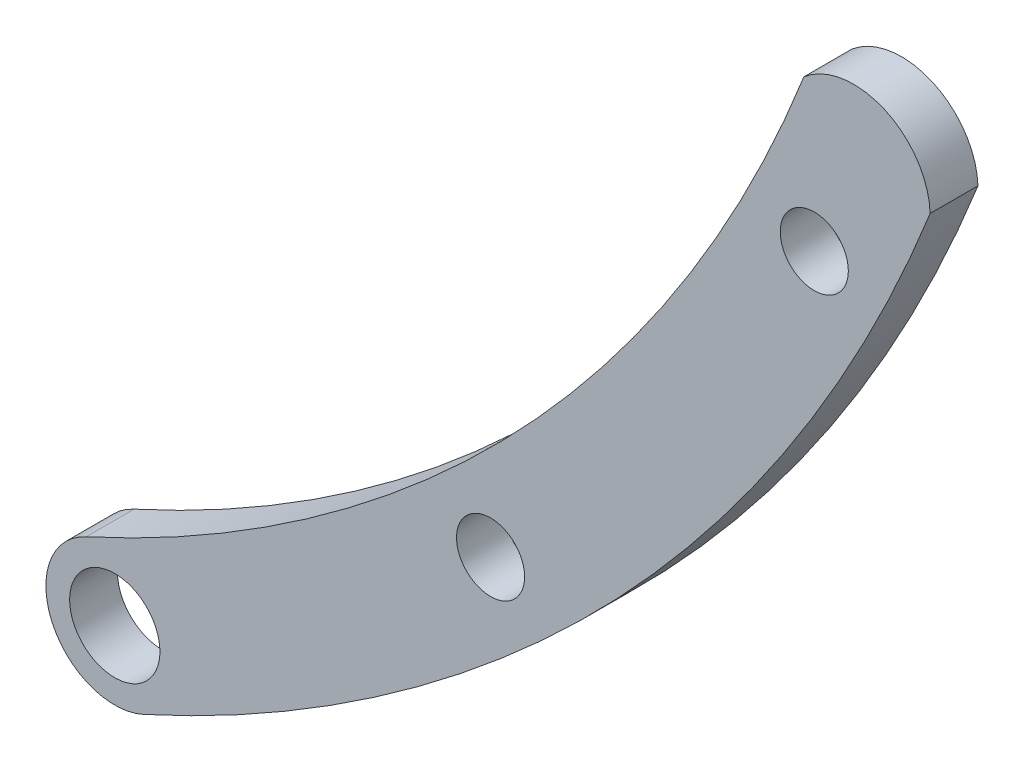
from build123d import *

# Parameters (mm, degrees)
SKETCH1_R                 = 1.4986
EXTRUDE1_DEPTH            = 1.5875
SKETCH3_R                 = 0.635
CUT_EXTRUDE1_DEPTH        = 6.35
CUT_EXTRUDE2_DEPTH        = 27.781218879
F_4_40_TAPPED_HOLE2_D     = 2.2606
F_4_40_TAPPED_HOLE2_DEPTH = 8.8646
F_4_40_TAPPED_HOLE2_TIP   = 0.679152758


with BuildPart() as part:
    # Sketch1 → Extrude1 (new body)
    with BuildSketch(Plane.XY):
        with BuildLine():
            ThreePointArc((16.23761146, 18.648579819), (14.25936874, 21.205560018), (11.70238854, 19.227317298))
            ThreePointArc((11.70238854, 19.227317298), (3.083277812, -2.274448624), (-14.9158769, -16.856815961))
            ThreePointArc((-14.9158769, -16.856815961), (-16.051132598, -19.883825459), (-13.0241231, -21.019081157))
            ThreePointArc((-13.0241231, -21.019081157), (6.762533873, -4.988533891), (16.23761146, 18.648579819))
        make_face()
        with Locations((13.97, 18.937948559)):
            Circle(SKETCH1_R, mode=Mode.SUBTRACT)
        with Locations((-13.97, -18.937948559)):
            Circle(SKETCH1_R, mode=Mode.SUBTRACT)
    extrude(amount=EXTRUDE1_DEPTH)

    # Sketch3 → Cut-Extrude1 (cut)
    with BuildSketch(Plane.XY.offset(1.5875)):
        with Locations((-1.494354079, -10.733826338)):
            Circle(SKETCH3_R)
        with Locations((9.251723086, 3.433274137)):
            Circle(SKETCH3_R)
    extrude(amount=-CUT_EXTRUDE1_DEPTH, mode=Mode.SUBTRACT)

    # Sketch4 → Cut-Extrude2 (cut, through all)
    with BuildSketch(Plane.XY.offset(1.5875)):
        with BuildLine():
            Line((16.508944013, -84.170540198), (13.099135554, 6.445510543))
            ThreePointArc((13.099135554, 6.445510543), (11.578024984, 8.677471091), (8.906792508, 8.277543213))
            Line((8.906792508, 8.277543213), (-59.908156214, -50.77665459))
            Line((-59.908156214, -50.77665459), (12.714036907, 115.408780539))
            Line((12.714036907, 115.408780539), (89.131137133, 82.014894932))
            Line((89.131137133, 82.014894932), (16.508944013, -84.170540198))
        make_face()
    extrude(amount=-CUT_EXTRUDE2_DEPTH, mode=Mode.SUBTRACT)

    # 4-40 Tapped Hole2
    with Locations(Plane(origin=(-1.494354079, -10.733826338, 1.5875), x_dir=(1, 0, 0), z_dir=(0, 0, 1))):
        with Locations((0, 0), (10.746077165, 14.167100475)):
            Hole(F_4_40_TAPPED_HOLE2_D / 2, depth=F_4_40_TAPPED_HOLE2_DEPTH)
            with Locations((0, 0, -(F_4_40_TAPPED_HOLE2_DEPTH + F_4_40_TAPPED_HOLE2_TIP / 2))):  # 118° drill point
                Cone(0, F_4_40_TAPPED_HOLE2_D / 2, F_4_40_TAPPED_HOLE2_TIP, mode=Mode.SUBTRACT)


solid = part.part
